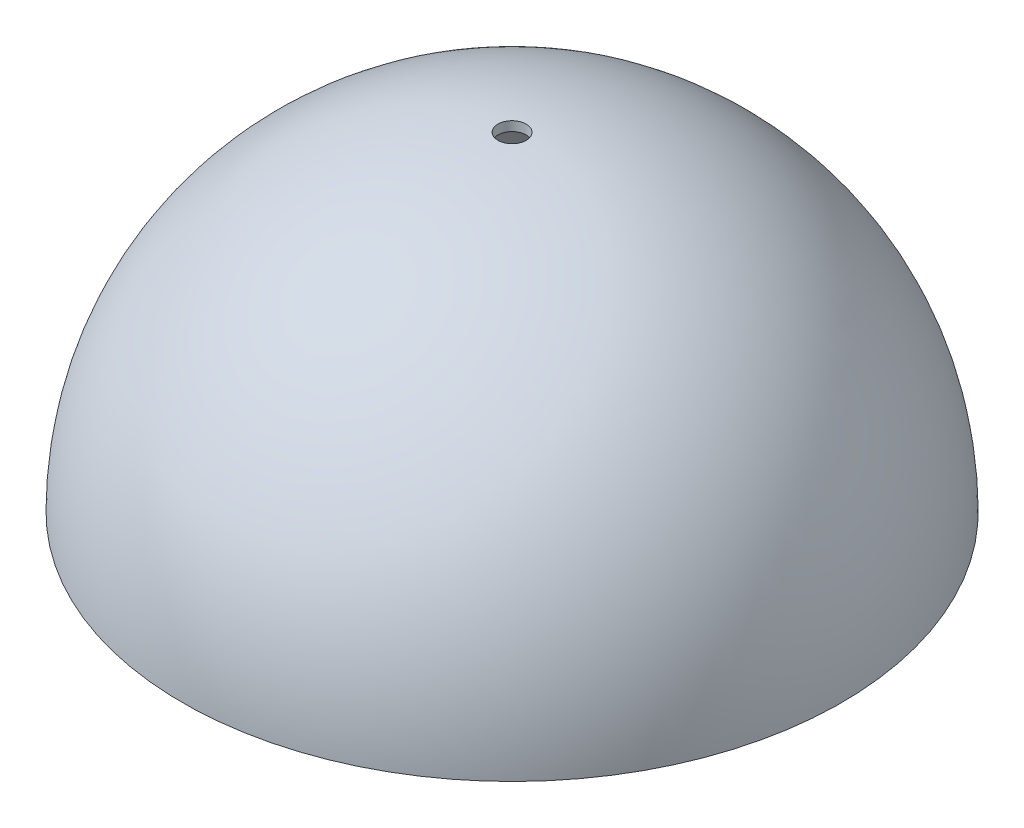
ISO-10303-21;
HEADER;
FILE_DESCRIPTION(('STEP AP214'),'2;1');
FILE_NAME('part.step','',(''),(''),'','','');
FILE_SCHEMA(('AUTOMOTIVE_DESIGN { 1 0 10303 214 1 1 1 1 }'));
ENDSEC;
DATA;
#1=APPLICATION_CONTEXT('core data for automotive mechanical design processes');
#2=APPLICATION_PROTOCOL_DEFINITION('international standard','automotive_design',2000,#1);
#3=PRODUCT_CONTEXT('',#1,'mechanical');
#4=PRODUCT('Part','Part','',(#3));
#5=PRODUCT_RELATED_PRODUCT_CATEGORY('part','',(#4));
#6=PRODUCT_DEFINITION_FORMATION('','',#4);
#7=PRODUCT_DEFINITION_CONTEXT('part definition',#1,'design');
#8=PRODUCT_DEFINITION('design','',#6,#7);
#9=PRODUCT_DEFINITION_SHAPE('','',#8);
#10=(LENGTH_UNIT() NAMED_UNIT(*) SI_UNIT(.MILLI.,.METRE.));
#11=(NAMED_UNIT(*) PLANE_ANGLE_UNIT() SI_UNIT($,.RADIAN.));
#12=(NAMED_UNIT(*) SI_UNIT($,.STERADIAN.) SOLID_ANGLE_UNIT());
#13=UNCERTAINTY_MEASURE_WITH_UNIT(LENGTH_MEASURE(1.E-05),#10,'distance_accuracy_value','');
#14=(GEOMETRIC_REPRESENTATION_CONTEXT(3) GLOBAL_UNCERTAINTY_ASSIGNED_CONTEXT((#13)) GLOBAL_UNIT_ASSIGNED_CONTEXT((#10,
#11,#12)) REPRESENTATION_CONTEXT('',''));
#15=CARTESIAN_POINT('',(0.,0.,0.));
#16=DIRECTION('',(0.,0.,1.));
#17=DIRECTION('',(1.,0.,0.));
#18=AXIS2_PLACEMENT_3D('',#15,#16,#17);
#19=CARTESIAN_POINT('',(0.,0.,0.));
#20=DIRECTION('',(0.,-1.,0.));
#21=DIRECTION('',(-1.,0.,0.));
#22=AXIS2_PLACEMENT_3D('',#19,#20,#21);
#23=SPHERICAL_SURFACE('',#22,34.);
#24=CARTESIAN_POINT('',(0.,0.,0.));
#25=DIRECTION('',(0.,-1.,0.));
#26=DIRECTION('',(0.,0.,-1.));
#27=AXIS2_PLACEMENT_3D('',#24,#25,#26);
#28=CIRCLE('',#27,34.);
#29=CARTESIAN_POINT('',(0.,0.,-34.));
#30=VERTEX_POINT('',#29);
#31=EDGE_CURVE('E10',#30,#30,#28,.T.);
#32=ORIENTED_EDGE('',*,*,#31,.T.);
#33=EDGE_LOOP('',(#32));
#34=FACE_BOUND('',#33,.T.);
#35=CARTESIAN_POINT('',(0.,33.9668956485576,0.));
#36=DIRECTION('',(0.,-1.,0.));
#37=DIRECTION('',(0.,0.,-1.));
#38=AXIS2_PLACEMENT_3D('',#35,#36,#37);
#39=CIRCLE('',#38,1.5);
#40=CARTESIAN_POINT('',(0.,33.9668956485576,-1.5));
#41=VERTEX_POINT('',#40);
#42=EDGE_CURVE('E43',#41,#41,#39,.F.);
#43=ORIENTED_EDGE('',*,*,#42,.T.);
#44=EDGE_LOOP('',(#43));
#45=FACE_BOUND('',#44,.T.);
#46=ADVANCED_FACE('F32',(#34,#45),#23,.F.);
#47=CARTESIAN_POINT('',(0.,0.,0.));
#48=DIRECTION('',(0.,-1.,0.));
#49=DIRECTION('',(-1.,0.,0.));
#50=AXIS2_PLACEMENT_3D('',#47,#48,#49);
#51=SPHERICAL_SURFACE('',#50,35.);
#52=CARTESIAN_POINT('',(0.,0.,0.));
#53=DIRECTION('',(0.,-1.,0.));
#54=DIRECTION('',(0.,0.,-1.));
#55=AXIS2_PLACEMENT_3D('',#52,#53,#54);
#56=CIRCLE('',#55,35.);
#57=CARTESIAN_POINT('',(0.,0.,-35.));
#58=VERTEX_POINT('',#57);
#59=EDGE_CURVE('E39',#58,#58,#56,.T.);
#60=ORIENTED_EDGE('',*,*,#59,.F.);
#61=EDGE_LOOP('',(#60));
#62=FACE_BOUND('',#61,.T.);
#63=CARTESIAN_POINT('',(0.,34.9678423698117,0.));
#64=DIRECTION('',(0.,-1.,0.));
#65=DIRECTION('',(0.,0.,-1.));
#66=AXIS2_PLACEMENT_3D('',#63,#64,#65);
#67=CIRCLE('',#66,1.5);
#68=CARTESIAN_POINT('',(0.,34.9678423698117,-1.5));
#69=VERTEX_POINT('',#68);
#70=EDGE_CURVE('E35',#69,#69,#67,.F.);
#71=ORIENTED_EDGE('',*,*,#70,.F.);
#72=EDGE_LOOP('',(#71));
#73=FACE_BOUND('',#72,.T.);
#74=ADVANCED_FACE('F54',(#62,#73),#51,.T.);
#75=CARTESIAN_POINT('',(35.,0.,0.));
#76=DIRECTION('',(0.,1.,0.));
#77=DIRECTION('',(0.,0.,1.));
#78=AXIS2_PLACEMENT_3D('',#75,#76,#77);
#79=PLANE('',#78);
#80=ORIENTED_EDGE('',*,*,#31,.F.);
#81=EDGE_LOOP('',(#80));
#82=FACE_BOUND('',#81,.T.);
#83=ORIENTED_EDGE('',*,*,#59,.T.);
#84=EDGE_LOOP('',(#83));
#85=FACE_BOUND('',#84,.T.);
#86=ADVANCED_FACE('F56',(#82,#85),#79,.F.);
#87=CARTESIAN_POINT('',(0.,35.,0.));
#88=DIRECTION('',(0.,-1.,0.));
#89=DIRECTION('',(0.,0.,-1.));
#90=AXIS2_PLACEMENT_3D('',#87,#88,#89);
#91=CYLINDRICAL_SURFACE('',#90,1.5);
#92=ORIENTED_EDGE('',*,*,#42,.F.);
#93=EDGE_LOOP('',(#92));
#94=FACE_BOUND('',#93,.T.);
#95=ORIENTED_EDGE('',*,*,#70,.T.);
#96=EDGE_LOOP('',(#95));
#97=FACE_BOUND('',#96,.T.);
#98=ADVANCED_FACE('F52',(#94,#97),#91,.F.);
#99=CLOSED_SHELL('',(#46,#74,#86,#98));
#100=MANIFOLD_SOLID_BREP('B2',#99);
#101=ADVANCED_BREP_SHAPE_REPRESENTATION('',(#18,#100),#14);
#102=SHAPE_DEFINITION_REPRESENTATION(#9,#101);
ENDSEC;
END-ISO-10303-21;
